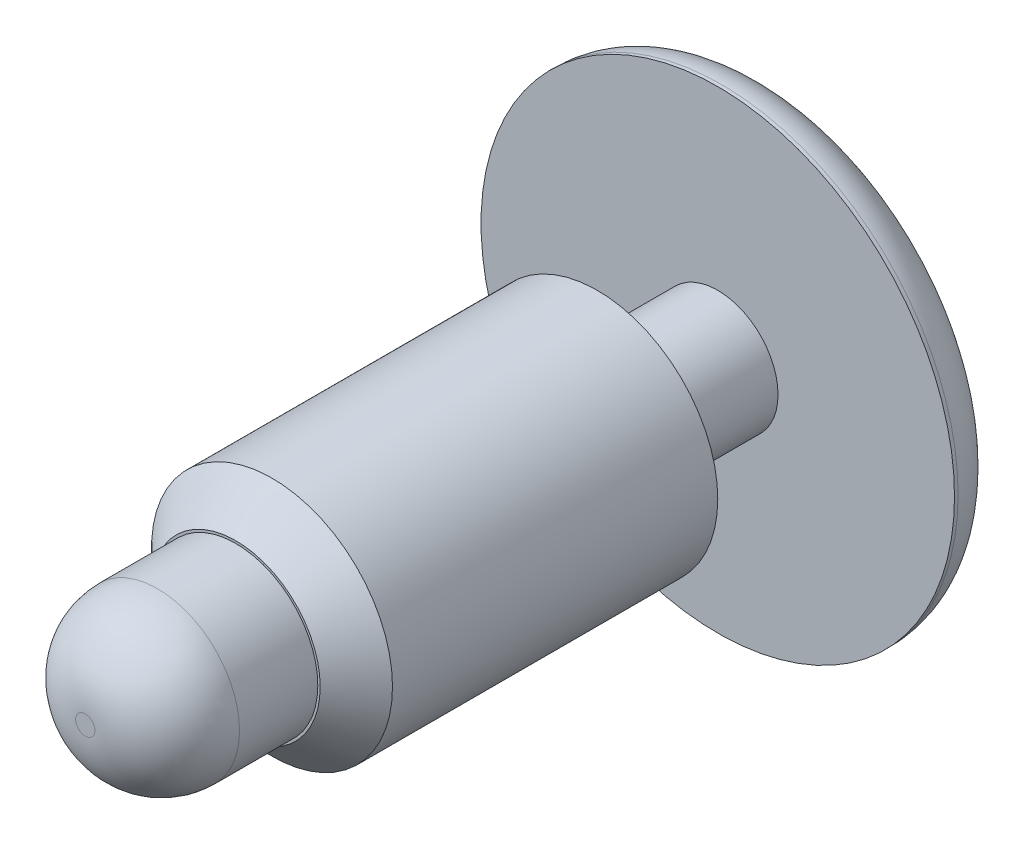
from build123d import *

# Parameters (mm, degrees)
SKETCH1_R      = 4.9911
EXTRUDE1_DEPTH = 1.0922
SKETCH2_R      = 1.27
EXTRUDE2_DEPTH = 10.16
SKETCH3_R      = 2.54
EXTRUDE3_DEPTH = 7.62
SKETCH4_R      = 1.7272
EXTRUDE4_DEPTH = 3.175
FILLET1_R      = 1.524
CHAMFER4_SIZE  = 0.762
FILLET2_R      = 1.016


with BuildPart() as part:
    # Sketch1 → Extrude1 (new body)
    with BuildSketch(Plane.XY):
        Circle(SKETCH1_R)
    extrude(amount=EXTRUDE1_DEPTH)

    # Sketch2 → Extrude2 (add)
    with BuildSketch(Plane.XY.offset(1.0922)):
        Circle(SKETCH2_R)
    extrude(amount=EXTRUDE2_DEPTH)

    # Sketch3 → Extrude3 (add)
    with BuildSketch(Plane.XY.offset(11.2522)):
        Circle(SKETCH3_R)
    extrude(amount=-EXTRUDE3_DEPTH)

    # Sketch4 → Extrude4 (add)
    with BuildSketch(Plane.XY.offset(11.2522)):
        Circle(SKETCH4_R)
    extrude(amount=EXTRUDE4_DEPTH)

    # Fillet1
    fillet1_edges = [part.edges().sort_by_distance(p)[0] for p in [
        (-1.7272, 0, 14.4272),
    ]]
    fillet(fillet1_edges, radius=FILLET1_R)

    # Chamfer4
    chamfer4_edges = [part.edges().sort_by_distance(p)[0] for p in [
        (-2.54, 0, 11.2522),
    ]]
    chamfer(chamfer4_edges, length=CHAMFER4_SIZE)

    # Fillet2
    fillet2_edges = [part.edges().sort_by_distance(p)[0] for p in [
        (-4.9911, 0, 0),
    ]]
    fillet(fillet2_edges, radius=FILLET2_R)


solid = part.part
